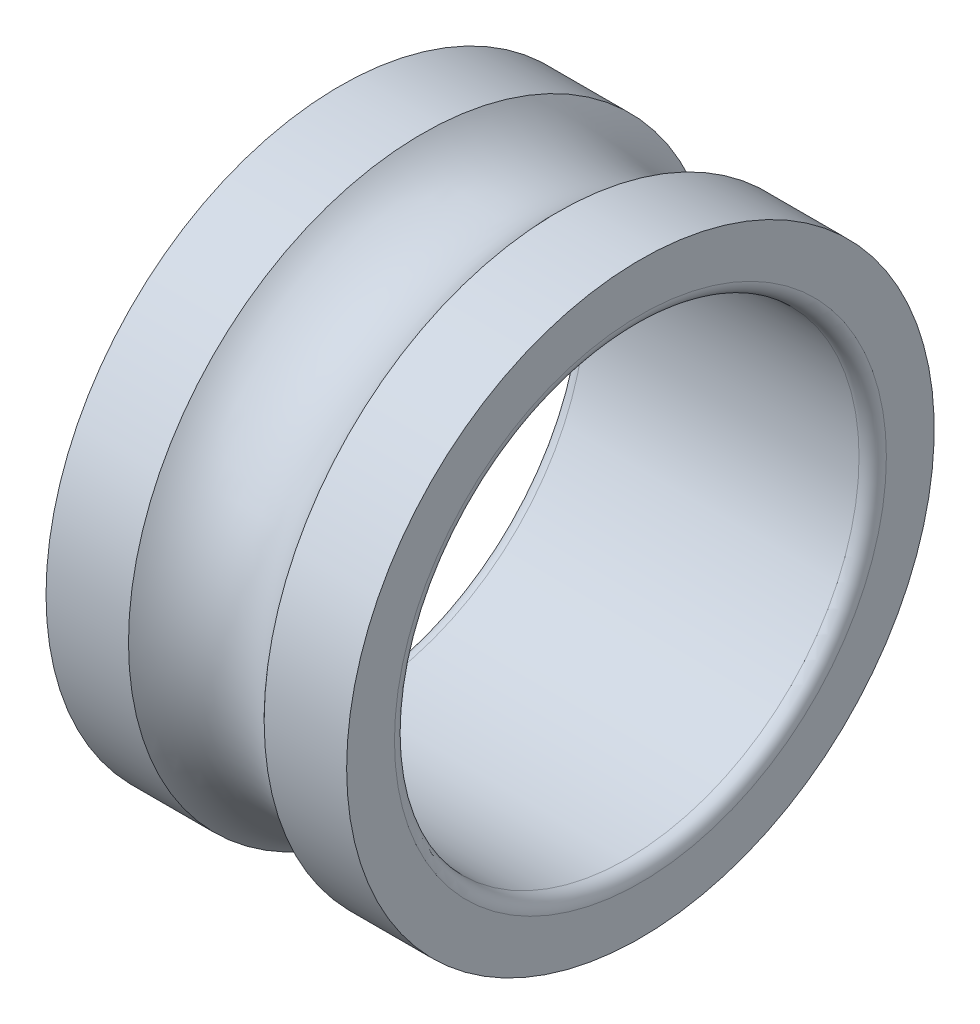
ISO-10303-21;
HEADER;
FILE_DESCRIPTION(('STEP AP214'),'2;1');
FILE_NAME('part.step','',(''),(''),'','','');
FILE_SCHEMA(('AUTOMOTIVE_DESIGN { 1 0 10303 214 1 1 1 1 }'));
ENDSEC;
DATA;
#1=APPLICATION_CONTEXT('core data for automotive mechanical design processes');
#2=APPLICATION_PROTOCOL_DEFINITION('international standard','automotive_design',2000,#1);
#3=PRODUCT_CONTEXT('',#1,'mechanical');
#4=PRODUCT('Part','Part','',(#3));
#5=PRODUCT_RELATED_PRODUCT_CATEGORY('part','',(#4));
#6=PRODUCT_DEFINITION_FORMATION('','',#4);
#7=PRODUCT_DEFINITION_CONTEXT('part definition',#1,'design');
#8=PRODUCT_DEFINITION('design','',#6,#7);
#9=PRODUCT_DEFINITION_SHAPE('','',#8);
#10=(LENGTH_UNIT() NAMED_UNIT(*) SI_UNIT(.MILLI.,.METRE.));
#11=(NAMED_UNIT(*) PLANE_ANGLE_UNIT() SI_UNIT($,.RADIAN.));
#12=(NAMED_UNIT(*) SI_UNIT($,.STERADIAN.) SOLID_ANGLE_UNIT());
#13=UNCERTAINTY_MEASURE_WITH_UNIT(LENGTH_MEASURE(1.E-05),#10,'distance_accuracy_value','');
#14=(GEOMETRIC_REPRESENTATION_CONTEXT(3) GLOBAL_UNCERTAINTY_ASSIGNED_CONTEXT((#13)) GLOBAL_UNIT_ASSIGNED_CONTEXT((#10,
#11,#12)) REPRESENTATION_CONTEXT('',''));
#15=CARTESIAN_POINT('',(0.,0.,0.));
#16=DIRECTION('',(0.,0.,1.));
#17=DIRECTION('',(1.,0.,0.));
#18=AXIS2_PLACEMENT_3D('',#15,#16,#17);
#19=CARTESIAN_POINT('',(0.,0.,0.));
#20=DIRECTION('',(-1.,0.,0.));
#21=DIRECTION('',(0.,0.,1.));
#22=AXIS2_PLACEMENT_3D('',#19,#20,#21);
#23=CYLINDRICAL_SURFACE('',#22,10.75);
#24=CARTESIAN_POINT('',(0.,0.,0.));
#25=DIRECTION('',(-1.,0.,0.));
#26=DIRECTION('',(0.,0.,1.));
#27=AXIS2_PLACEMENT_3D('',#24,#25,#26);
#28=CIRCLE('',#27,10.75);
#29=CARTESIAN_POINT('',(0.,0.,10.75));
#30=VERTEX_POINT('',#29);
#31=EDGE_CURVE('E49',#30,#30,#28,.T.);
#32=ORIENTED_EDGE('',*,*,#31,.F.);
#33=EDGE_LOOP('',(#32));
#34=FACE_BOUND('',#33,.T.);
#35=CARTESIAN_POINT('',(3.01796734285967,0.,0.));
#36=DIRECTION('',(-1.,0.,0.));
#37=DIRECTION('',(0.,0.,1.));
#38=AXIS2_PLACEMENT_3D('',#35,#36,#37);
#39=CIRCLE('',#38,10.75);
#40=CARTESIAN_POINT('',(3.01796734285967,0.,10.75));
#41=VERTEX_POINT('',#40);
#42=EDGE_CURVE('E58',#41,#41,#39,.T.);
#43=ORIENTED_EDGE('',*,*,#42,.T.);
#44=EDGE_LOOP('',(#43));
#45=FACE_BOUND('',#44,.T.);
#46=ADVANCED_FACE('F30',(#34,#45),#23,.T.);
#47=CARTESIAN_POINT('',(0.,10.75,0.));
#48=DIRECTION('',(1.,0.,0.));
#49=DIRECTION('',(0.,0.,-1.));
#50=AXIS2_PLACEMENT_3D('',#47,#48,#49);
#51=PLANE('',#50);
#52=CARTESIAN_POINT('',(0.,0.,0.));
#53=DIRECTION('',(1.,0.,0.));
#54=DIRECTION('',(0.,0.,-1.));
#55=AXIS2_PLACEMENT_3D('',#52,#53,#54);
#56=CIRCLE('',#55,9.);
#57=CARTESIAN_POINT('',(0.,0.,-9.));
#58=VERTEX_POINT('',#57);
#59=EDGE_CURVE('E10',#58,#58,#56,.T.);
#60=ORIENTED_EDGE('',*,*,#59,.T.);
#61=EDGE_LOOP('',(#60));
#62=FACE_BOUND('',#61,.T.);
#63=ORIENTED_EDGE('',*,*,#31,.T.);
#64=EDGE_LOOP('',(#63));
#65=FACE_BOUND('',#64,.T.);
#66=ADVANCED_FACE('F80',(#62,#65),#51,.F.);
#67=CARTESIAN_POINT('',(11.,8.1,0.));
#68=DIRECTION('',(-1.,0.,0.));
#69=DIRECTION('',(0.,0.,1.));
#70=AXIS2_PLACEMENT_3D('',#67,#68,#69);
#71=PLANE('',#70);
#72=CARTESIAN_POINT('',(11.,0.,0.));
#73=DIRECTION('',(-1.,0.,0.));
#74=DIRECTION('',(0.,0.,1.));
#75=AXIS2_PLACEMENT_3D('',#72,#73,#74);
#76=CIRCLE('',#75,9.);
#77=CARTESIAN_POINT('',(11.,0.,9.));
#78=VERTEX_POINT('',#77);
#79=EDGE_CURVE('E36',#78,#78,#76,.T.);
#80=ORIENTED_EDGE('',*,*,#79,.T.);
#81=EDGE_LOOP('',(#80));
#82=FACE_BOUND('',#81,.T.);
#83=CARTESIAN_POINT('',(11.,0.,0.));
#84=DIRECTION('',(-1.,0.,0.));
#85=DIRECTION('',(0.,0.,1.));
#86=AXIS2_PLACEMENT_3D('',#83,#84,#85);
#87=CIRCLE('',#86,10.75);
#88=CARTESIAN_POINT('',(11.,0.,10.75));
#89=VERTEX_POINT('',#88);
#90=EDGE_CURVE('E52',#89,#89,#87,.T.);
#91=ORIENTED_EDGE('',*,*,#90,.F.);
#92=EDGE_LOOP('',(#91));
#93=FACE_BOUND('',#92,.T.);
#94=ADVANCED_FACE('F76',(#82,#93),#71,.F.);
#95=CARTESIAN_POINT('',(0.,0.,0.));
#96=DIRECTION('',(-1.,0.,0.));
#97=DIRECTION('',(0.,0.,1.));
#98=AXIS2_PLACEMENT_3D('',#95,#96,#97);
#99=CYLINDRICAL_SURFACE('',#98,10.75);
#100=CARTESIAN_POINT('',(7.98203265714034,0.,0.));
#101=DIRECTION('',(-1.,0.,0.));
#102=DIRECTION('',(0.,0.,1.));
#103=AXIS2_PLACEMENT_3D('',#100,#101,#102);
#104=CIRCLE('',#103,10.75);
#105=CARTESIAN_POINT('',(7.98203265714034,0.,10.75));
#106=VERTEX_POINT('',#105);
#107=EDGE_CURVE('E55',#106,#106,#104,.T.);
#108=ORIENTED_EDGE('',*,*,#107,.F.);
#109=EDGE_LOOP('',(#108));
#110=FACE_BOUND('',#109,.T.);
#111=ORIENTED_EDGE('',*,*,#90,.T.);
#112=EDGE_LOOP('',(#111));
#113=FACE_BOUND('',#112,.T.);
#114=ADVANCED_FACE('F66',(#110,#113),#99,.T.);
#115=CARTESIAN_POINT('',(5.5,0.,0.));
#116=DIRECTION('',(-1.,0.,0.));
#117=DIRECTION('',(0.,0.,1.));
#118=AXIS2_PLACEMENT_3D('',#115,#116,#117);
#119=TOROIDAL_SURFACE('',#118,12.975,3.33333333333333);
#120=ORIENTED_EDGE('',*,*,#107,.T.);
#121=EDGE_LOOP('',(#120));
#122=FACE_BOUND('',#121,.T.);
#123=ORIENTED_EDGE('',*,*,#42,.F.);
#124=EDGE_LOOP('',(#123));
#125=FACE_BOUND('',#124,.T.);
#126=ADVANCED_FACE('F63',(#122,#125),#119,.F.);
#127=CARTESIAN_POINT('',(0.,0.,0.));
#128=DIRECTION('',(1.,0.,0.));
#129=DIRECTION('',(0.,0.,-1.));
#130=AXIS2_PLACEMENT_3D('',#127,#128,#129);
#131=CYLINDRICAL_SURFACE('',#130,8.5);
#132=CARTESIAN_POINT('',(10.5,0.,0.));
#133=DIRECTION('',(-1.,0.,0.));
#134=DIRECTION('',(0.,0.,1.));
#135=AXIS2_PLACEMENT_3D('',#132,#133,#134);
#136=CIRCLE('',#135,8.5);
#137=CARTESIAN_POINT('',(10.5,0.,8.5));
#138=VERTEX_POINT('',#137);
#139=EDGE_CURVE('E40',#138,#138,#136,.F.);
#140=ORIENTED_EDGE('',*,*,#139,.T.);
#141=EDGE_LOOP('',(#140));
#142=FACE_BOUND('',#141,.T.);
#143=CARTESIAN_POINT('',(0.5,0.,0.));
#144=DIRECTION('',(1.,0.,0.));
#145=DIRECTION('',(0.,0.,-1.));
#146=AXIS2_PLACEMENT_3D('',#143,#144,#145);
#147=CIRCLE('',#146,8.5);
#148=CARTESIAN_POINT('',(0.5,0.,-8.5));
#149=VERTEX_POINT('',#148);
#150=EDGE_CURVE('E44',#149,#149,#147,.F.);
#151=ORIENTED_EDGE('',*,*,#150,.T.);
#152=EDGE_LOOP('',(#151));
#153=FACE_BOUND('',#152,.T.);
#154=ADVANCED_FACE('F65',(#142,#153),#131,.F.);
#155=CARTESIAN_POINT('',(10.5,0.,0.));
#156=DIRECTION('',(-1.,0.,0.));
#157=DIRECTION('',(0.,0.,1.));
#158=AXIS2_PLACEMENT_3D('',#155,#156,#157);
#159=TOROIDAL_SURFACE('',#158,9.,0.5);
#160=ORIENTED_EDGE('',*,*,#79,.F.);
#161=EDGE_LOOP('',(#160));
#162=FACE_BOUND('',#161,.T.);
#163=ORIENTED_EDGE('',*,*,#139,.F.);
#164=EDGE_LOOP('',(#163));
#165=FACE_BOUND('',#164,.T.);
#166=ADVANCED_FACE('F73',(#162,#165),#159,.T.);
#167=CARTESIAN_POINT('',(0.5,0.,0.));
#168=DIRECTION('',(1.,0.,0.));
#169=DIRECTION('',(0.,0.,-1.));
#170=AXIS2_PLACEMENT_3D('',#167,#168,#169);
#171=TOROIDAL_SURFACE('',#170,9.,0.5);
#172=ORIENTED_EDGE('',*,*,#150,.F.);
#173=EDGE_LOOP('',(#172));
#174=FACE_BOUND('',#173,.T.);
#175=ORIENTED_EDGE('',*,*,#59,.F.);
#176=EDGE_LOOP('',(#175));
#177=FACE_BOUND('',#176,.T.);
#178=ADVANCED_FACE('F119',(#174,#177),#171,.T.);
#179=CLOSED_SHELL('',(#46,#66,#94,#114,#126,#154,#166,#178));
#180=MANIFOLD_SOLID_BREP('B2',#179);
#181=ADVANCED_BREP_SHAPE_REPRESENTATION('',(#18,#180),#14);
#182=SHAPE_DEFINITION_REPRESENTATION(#9,#181);
ENDSEC;
END-ISO-10303-21;
